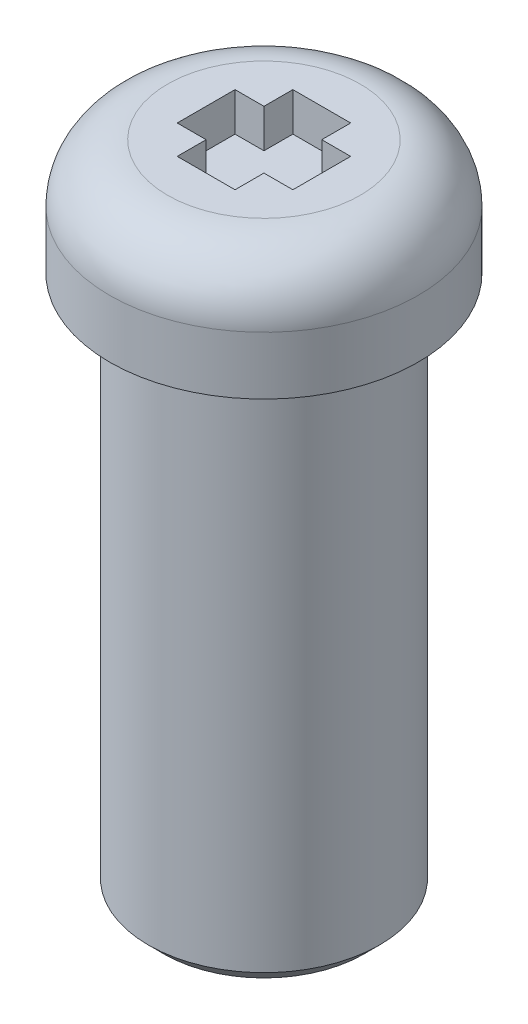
ISO-10303-21;
HEADER;
FILE_DESCRIPTION(('STEP AP214'),'2;1');
FILE_NAME('part.step','',(''),(''),'','','');
FILE_SCHEMA(('AUTOMOTIVE_DESIGN { 1 0 10303 214 1 1 1 1 }'));
ENDSEC;
DATA;
#1=APPLICATION_CONTEXT('core data for automotive mechanical design processes');
#2=APPLICATION_PROTOCOL_DEFINITION('international standard','automotive_design',2000,#1);
#3=PRODUCT_CONTEXT('',#1,'mechanical');
#4=PRODUCT('Part','Part','',(#3));
#5=PRODUCT_RELATED_PRODUCT_CATEGORY('part','',(#4));
#6=PRODUCT_DEFINITION_FORMATION('','',#4);
#7=PRODUCT_DEFINITION_CONTEXT('part definition',#1,'design');
#8=PRODUCT_DEFINITION('design','',#6,#7);
#9=PRODUCT_DEFINITION_SHAPE('','',#8);
#10=(LENGTH_UNIT() NAMED_UNIT(*) SI_UNIT(.MILLI.,.METRE.));
#11=(NAMED_UNIT(*) PLANE_ANGLE_UNIT() SI_UNIT($,.RADIAN.));
#12=(NAMED_UNIT(*) SI_UNIT($,.STERADIAN.) SOLID_ANGLE_UNIT());
#13=UNCERTAINTY_MEASURE_WITH_UNIT(LENGTH_MEASURE(1.E-05),#10,'distance_accuracy_value','');
#14=(GEOMETRIC_REPRESENTATION_CONTEXT(3) GLOBAL_UNCERTAINTY_ASSIGNED_CONTEXT((#13)) GLOBAL_UNIT_ASSIGNED_CONTEXT((#10,
#11,#12)) REPRESENTATION_CONTEXT('',''));
#15=CARTESIAN_POINT('',(0.,0.,0.));
#16=DIRECTION('',(0.,0.,1.));
#17=DIRECTION('',(1.,0.,0.));
#18=AXIS2_PLACEMENT_3D('',#15,#16,#17);
#19=CARTESIAN_POINT('',(4.00000000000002,0.,0.));
#20=DIRECTION('',(0.,1.,0.));
#21=DIRECTION('',(0.,0.,1.));
#22=AXIS2_PLACEMENT_3D('',#19,#20,#21);
#23=PLANE('',#22);
#24=CARTESIAN_POINT('',(0.,0.,0.));
#25=DIRECTION('',(0.,1.,0.));
#26=DIRECTION('',(0.,0.,1.));
#27=AXIS2_PLACEMENT_3D('',#24,#25,#26);
#28=CIRCLE('',#27,3.4572);
#29=CARTESIAN_POINT('',(0.,0.,3.4572));
#30=VERTEX_POINT('',#29);
#31=EDGE_CURVE('E222',#30,#30,#28,.T.);
#32=ORIENTED_EDGE('',*,*,#31,.T.);
#33=EDGE_LOOP('',(#32));
#34=FACE_BOUND('',#33,.T.);
#35=CARTESIAN_POINT('',(0.,0.,0.));
#36=DIRECTION('',(0.,1.,0.));
#37=DIRECTION('',(0.,0.,1.));
#38=AXIS2_PLACEMENT_3D('',#35,#36,#37);
#39=CIRCLE('',#38,4.);
#40=CARTESIAN_POINT('',(0.,0.,4.00000000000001));
#41=VERTEX_POINT('',#40);
#42=EDGE_CURVE('E216',#41,#41,#39,.T.);
#43=ORIENTED_EDGE('',*,*,#42,.F.);
#44=EDGE_LOOP('',(#43));
#45=FACE_BOUND('',#44,.T.);
#46=ADVANCED_FACE('F44',(#34,#45),#23,.F.);
#47=CARTESIAN_POINT('',(0.750000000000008,2.,1.50000000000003));
#48=DIRECTION('',(1.,0.,0.));
#49=DIRECTION('',(0.,0.,-1.));
#50=AXIS2_PLACEMENT_3D('',#47,#48,#49);
#51=PLANE('',#50);
#52=DIRECTION('',(0.,1.,0.));
#53=VECTOR('',#52,1.);
#54=CARTESIAN_POINT('',(0.750000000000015,2.,0.750000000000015));
#55=LINE('',#54,#53);
#56=CARTESIAN_POINT('',(0.750000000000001,2.,0.750000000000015));
#57=VERTEX_POINT('',#56);
#58=CARTESIAN_POINT('',(0.750000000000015,3.,0.750000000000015));
#59=VERTEX_POINT('',#58);
#60=EDGE_CURVE('E166',#57,#59,#55,.T.);
#61=ORIENTED_EDGE('',*,*,#60,.F.);
#62=DIRECTION('',(0.,0.,-1.));
#63=VECTOR('',#62,1.);
#64=CARTESIAN_POINT('',(0.750000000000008,2.,1.50000000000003));
#65=LINE('',#64,#63);
#66=CARTESIAN_POINT('',(0.750000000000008,2.,1.50000000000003));
#67=VERTEX_POINT('',#66);
#68=EDGE_CURVE('E175',#67,#57,#65,.T.);
#69=ORIENTED_EDGE('',*,*,#68,.F.);
#70=DIRECTION('',(0.,1.,0.));
#71=VECTOR('',#70,1.);
#72=CARTESIAN_POINT('',(0.750000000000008,2.,1.50000000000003));
#73=LINE('',#72,#71);
#74=CARTESIAN_POINT('',(0.750000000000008,3.,1.50000000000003));
#75=VERTEX_POINT('',#74);
#76=EDGE_CURVE('E201',#67,#75,#73,.T.);
#77=ORIENTED_EDGE('',*,*,#76,.T.);
#78=DIRECTION('',(0.,0.,-1.));
#79=VECTOR('',#78,1.);
#80=CARTESIAN_POINT('',(0.750000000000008,3.,1.50000000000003));
#81=LINE('',#80,#79);
#82=EDGE_CURVE('E188',#75,#59,#81,.T.);
#83=ORIENTED_EDGE('',*,*,#82,.T.);
#84=EDGE_LOOP('',(#61,#69,#77,#83));
#85=FACE_BOUND('',#84,.T.);
#86=ADVANCED_FACE('F238',(#85),#51,.F.);
#87=CARTESIAN_POINT('',(-0.749999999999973,2.,1.50000000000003));
#88=DIRECTION('',(1.,0.,0.));
#89=DIRECTION('',(0.,0.,-1.));
#90=AXIS2_PLACEMENT_3D('',#87,#88,#89);
#91=PLANE('',#90);
#92=DIRECTION('',(0.,0.,-1.));
#93=VECTOR('',#92,1.);
#94=CARTESIAN_POINT('',(-0.749999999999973,2.,1.50000000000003));
#95=LINE('',#94,#93);
#96=CARTESIAN_POINT('',(-0.749999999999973,2.,1.50000000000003));
#97=VERTEX_POINT('',#96);
#98=CARTESIAN_POINT('',(-0.74999999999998,2.,0.749999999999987));
#99=VERTEX_POINT('',#98);
#100=EDGE_CURVE('E182',#97,#99,#95,.T.);
#101=ORIENTED_EDGE('',*,*,#100,.T.);
#102=DIRECTION('',(0.,1.,0.));
#103=VECTOR('',#102,1.);
#104=CARTESIAN_POINT('',(-0.74999999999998,2.,0.749999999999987));
#105=LINE('',#104,#103);
#106=CARTESIAN_POINT('',(-0.74999999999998,3.,0.749999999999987));
#107=VERTEX_POINT('',#106);
#108=EDGE_CURVE('E163',#99,#107,#105,.T.);
#109=ORIENTED_EDGE('',*,*,#108,.T.);
#110=DIRECTION('',(0.,0.,-1.));
#111=VECTOR('',#110,1.);
#112=CARTESIAN_POINT('',(-0.749999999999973,3.,1.50000000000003));
#113=LINE('',#112,#111);
#114=CARTESIAN_POINT('',(-0.749999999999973,3.,1.50000000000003));
#115=VERTEX_POINT('',#114);
#116=EDGE_CURVE('E195',#115,#107,#113,.T.);
#117=ORIENTED_EDGE('',*,*,#116,.F.);
#118=DIRECTION('',(0.,1.,0.));
#119=VECTOR('',#118,1.);
#120=CARTESIAN_POINT('',(-0.749999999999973,2.,1.50000000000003));
#121=LINE('',#120,#119);
#122=EDGE_CURVE('E204',#97,#115,#121,.T.);
#123=ORIENTED_EDGE('',*,*,#122,.F.);
#124=EDGE_LOOP('',(#101,#109,#117,#123));
#125=FACE_BOUND('',#124,.T.);
#126=ADVANCED_FACE('F244',(#125),#91,.T.);
#127=CARTESIAN_POINT('',(0.,11.5925170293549,0.));
#128=DIRECTION('',(0.,1.,0.));
#129=DIRECTION('',(0.,0.,1.));
#130=AXIS2_PLACEMENT_3D('',#127,#128,#129);
#131=CYLINDRICAL_SURFACE('',#130,4.);
#132=CARTESIAN_POINT('',(0.,1.5,0.));
#133=DIRECTION('',(0.,1.,0.));
#134=DIRECTION('',(0.,0.,1.));
#135=AXIS2_PLACEMENT_3D('',#132,#133,#134);
#136=CIRCLE('',#135,4.);
#137=CARTESIAN_POINT('',(0.,1.5,4.00000000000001));
#138=VERTEX_POINT('',#137);
#139=EDGE_CURVE('E213',#138,#138,#136,.T.);
#140=ORIENTED_EDGE('',*,*,#139,.F.);
#141=EDGE_LOOP('',(#140));
#142=FACE_BOUND('',#141,.T.);
#143=ORIENTED_EDGE('',*,*,#42,.T.);
#144=EDGE_LOOP('',(#143));
#145=FACE_BOUND('',#144,.T.);
#146=ADVANCED_FACE('F250',(#142,#145),#131,.T.);
#147=CARTESIAN_POINT('',(0.,1.5,0.));
#148=DIRECTION('',(0.,1.,0.));
#149=DIRECTION('',(0.,0.,1.));
#150=AXIS2_PLACEMENT_3D('',#147,#148,#149);
#151=TOROIDAL_SURFACE('',#150,2.5,1.5);
#152=CARTESIAN_POINT('',(0.,3.,0.));
#153=DIRECTION('',(0.,1.,0.));
#154=DIRECTION('',(0.,0.,1.));
#155=AXIS2_PLACEMENT_3D('',#152,#153,#154);
#156=CIRCLE('',#155,2.5);
#157=CARTESIAN_POINT('',(0.,3.,2.5));
#158=VERTEX_POINT('',#157);
#159=EDGE_CURVE('E203',#158,#158,#156,.T.);
#160=ORIENTED_EDGE('',*,*,#159,.F.);
#161=EDGE_LOOP('',(#160));
#162=FACE_BOUND('',#161,.T.);
#163=ORIENTED_EDGE('',*,*,#139,.T.);
#164=EDGE_LOOP('',(#163));
#165=FACE_BOUND('',#164,.T.);
#166=ADVANCED_FACE('F253',(#162,#165),#151,.T.);
#167=CARTESIAN_POINT('',(0.,3.,0.));
#168=DIRECTION('',(0.,-1.,0.));
#169=DIRECTION('',(0.,0.,-1.));
#170=AXIS2_PLACEMENT_3D('',#167,#168,#169);
#171=PLANE('',#170);
#172=CARTESIAN_POINT('',(0.750000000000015,3.,-0.750000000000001));
#173=VERTEX_POINT('',#172);
#174=CARTESIAN_POINT('',(0.750000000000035,3.,-1.5));
#175=VERTEX_POINT('',#174);
#176=EDGE_CURVE('E174',#173,#175,#81,.T.);
#177=ORIENTED_EDGE('',*,*,#176,.F.);
#178=DIRECTION('',(-1.,0.,0.));
#179=VECTOR('',#178,1.);
#180=CARTESIAN_POINT('',(1.50000000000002,3.,-0.750000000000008));
#181=LINE('',#180,#179);
#182=CARTESIAN_POINT('',(1.50000000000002,3.,-0.750000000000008));
#183=VERTEX_POINT('',#182);
#184=EDGE_CURVE('E410',#183,#173,#181,.T.);
#185=ORIENTED_EDGE('',*,*,#184,.F.);
#186=DIRECTION('',(0.,0.,1.));
#187=VECTOR('',#186,1.);
#188=CARTESIAN_POINT('',(1.50000000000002,3.,-0.750000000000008));
#189=LINE('',#188,#187);
#190=CARTESIAN_POINT('',(1.50000000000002,3.,0.750000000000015));
#191=VERTEX_POINT('',#190);
#192=EDGE_CURVE('E141',#183,#191,#189,.T.);
#193=ORIENTED_EDGE('',*,*,#192,.T.);
#194=DIRECTION('',(-1.,0.,0.));
#195=VECTOR('',#194,1.);
#196=CARTESIAN_POINT('',(1.50000000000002,3.,0.750000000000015));
#197=LINE('',#196,#195);
#198=EDGE_CURVE('E395',#191,#59,#197,.T.);
#199=ORIENTED_EDGE('',*,*,#198,.T.);
#200=ORIENTED_EDGE('',*,*,#82,.F.);
#201=DIRECTION('',(-1.,0.,0.));
#202=VECTOR('',#201,1.);
#203=CARTESIAN_POINT('',(0.750000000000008,3.,1.50000000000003));
#204=LINE('',#203,#202);
#205=EDGE_CURVE('E198',#75,#115,#204,.T.);
#206=ORIENTED_EDGE('',*,*,#205,.T.);
#207=ORIENTED_EDGE('',*,*,#116,.T.);
#208=CARTESIAN_POINT('',(-1.49999999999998,3.,0.750000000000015));
#209=VERTEX_POINT('',#208);
#210=EDGE_CURVE('E401',#107,#209,#197,.T.);
#211=ORIENTED_EDGE('',*,*,#210,.T.);
#212=DIRECTION('',(0.,0.,-1.));
#213=VECTOR('',#212,1.);
#214=CARTESIAN_POINT('',(-1.49999999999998,3.,0.750000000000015));
#215=LINE('',#214,#213);
#216=CARTESIAN_POINT('',(-1.49999999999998,3.,-0.750000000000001));
#217=VERTEX_POINT('',#216);
#218=EDGE_CURVE('E405',#209,#217,#215,.T.);
#219=ORIENTED_EDGE('',*,*,#218,.T.);
#220=CARTESIAN_POINT('',(-0.749999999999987,3.,-0.750000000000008));
#221=VERTEX_POINT('',#220);
#222=EDGE_CURVE('E154',#221,#217,#181,.T.);
#223=ORIENTED_EDGE('',*,*,#222,.F.);
#224=CARTESIAN_POINT('',(-0.749999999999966,3.,-1.5));
#225=VERTEX_POINT('',#224);
#226=EDGE_CURVE('E194',#221,#225,#113,.T.);
#227=ORIENTED_EDGE('',*,*,#226,.T.);
#228=DIRECTION('',(1.,0.,0.));
#229=VECTOR('',#228,1.);
#230=CARTESIAN_POINT('',(-0.749999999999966,3.,-1.5));
#231=LINE('',#230,#229);
#232=EDGE_CURVE('E191',#225,#175,#231,.T.);
#233=ORIENTED_EDGE('',*,*,#232,.T.);
#234=EDGE_LOOP('',(#177,#185,#193,#199,#200,#206,#207,#211,#219,#223,#227,#233));
#235=FACE_BOUND('',#234,.T.);
#236=ORIENTED_EDGE('',*,*,#159,.T.);
#237=EDGE_LOOP('',(#236));
#238=FACE_BOUND('',#237,.T.);
#239=ADVANCED_FACE('F257',(#235,#238),#171,.F.);
#240=CARTESIAN_POINT('',(0.750000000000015,2.,-0.750000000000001));
#241=VERTEX_POINT('',#240);
#242=CARTESIAN_POINT('',(0.750000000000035,2.,-1.5));
#243=VERTEX_POINT('',#242);
#244=EDGE_CURVE('E179',#241,#243,#65,.T.);
#245=ORIENTED_EDGE('',*,*,#244,.F.);
#246=DIRECTION('',(0.,1.,0.));
#247=VECTOR('',#246,1.);
#248=CARTESIAN_POINT('',(0.750000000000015,2.,-0.750000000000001));
#249=LINE('',#248,#247);
#250=EDGE_CURVE('E171',#241,#173,#249,.T.);
#251=ORIENTED_EDGE('',*,*,#250,.T.);
#252=ORIENTED_EDGE('',*,*,#176,.T.);
#253=DIRECTION('',(0.,1.,0.));
#254=VECTOR('',#253,1.);
#255=CARTESIAN_POINT('',(0.750000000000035,2.,-1.5));
#256=LINE('',#255,#254);
#257=EDGE_CURVE('E187',#243,#175,#256,.T.);
#258=ORIENTED_EDGE('',*,*,#257,.F.);
#259=EDGE_LOOP('',(#245,#251,#252,#258));
#260=FACE_BOUND('',#259,.T.);
#261=ADVANCED_FACE('F247',(#260),#51,.F.);
#262=CARTESIAN_POINT('',(0.750000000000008,2.,1.50000000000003));
#263=DIRECTION('',(0.,0.,-1.));
#264=DIRECTION('',(-1.,0.,0.));
#265=AXIS2_PLACEMENT_3D('',#262,#263,#264);
#266=PLANE('',#265);
#267=ORIENTED_EDGE('',*,*,#205,.F.);
#268=ORIENTED_EDGE('',*,*,#76,.F.);
#269=DIRECTION('',(-1.,0.,0.));
#270=VECTOR('',#269,1.);
#271=CARTESIAN_POINT('',(0.750000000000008,2.,1.50000000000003));
#272=LINE('',#271,#270);
#273=EDGE_CURVE('E185',#67,#97,#272,.T.);
#274=ORIENTED_EDGE('',*,*,#273,.T.);
#275=ORIENTED_EDGE('',*,*,#122,.T.);
#276=EDGE_LOOP('',(#267,#268,#274,#275));
#277=FACE_BOUND('',#276,.T.);
#278=ADVANCED_FACE('F263',(#277),#266,.T.);
#279=DIRECTION('',(0.,1.,0.));
#280=VECTOR('',#279,1.);
#281=CARTESIAN_POINT('',(-0.749999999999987,2.,-0.750000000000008));
#282=LINE('',#281,#280);
#283=CARTESIAN_POINT('',(-0.749999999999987,2.,-0.750000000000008));
#284=VERTEX_POINT('',#283);
#285=EDGE_CURVE('E169',#284,#221,#282,.T.);
#286=ORIENTED_EDGE('',*,*,#285,.F.);
#287=CARTESIAN_POINT('',(-0.749999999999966,2.,-1.5));
#288=VERTEX_POINT('',#287);
#289=EDGE_CURVE('E137',#284,#288,#95,.T.);
#290=ORIENTED_EDGE('',*,*,#289,.T.);
#291=DIRECTION('',(0.,1.,0.));
#292=VECTOR('',#291,1.);
#293=CARTESIAN_POINT('',(-0.749999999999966,2.,-1.5));
#294=LINE('',#293,#292);
#295=EDGE_CURVE('E206',#288,#225,#294,.T.);
#296=ORIENTED_EDGE('',*,*,#295,.T.);
#297=ORIENTED_EDGE('',*,*,#226,.F.);
#298=EDGE_LOOP('',(#286,#290,#296,#297));
#299=FACE_BOUND('',#298,.T.);
#300=ADVANCED_FACE('F268',(#299),#91,.T.);
#301=CARTESIAN_POINT('',(-0.749999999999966,2.,-1.5));
#302=DIRECTION('',(0.,0.,1.));
#303=DIRECTION('',(1.,0.,0.));
#304=AXIS2_PLACEMENT_3D('',#301,#302,#303);
#305=PLANE('',#304);
#306=ORIENTED_EDGE('',*,*,#232,.F.);
#307=ORIENTED_EDGE('',*,*,#295,.F.);
#308=DIRECTION('',(1.,0.,0.));
#309=VECTOR('',#308,1.);
#310=CARTESIAN_POINT('',(-0.749999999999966,2.,-1.5));
#311=LINE('',#310,#309);
#312=EDGE_CURVE('E178',#288,#243,#311,.T.);
#313=ORIENTED_EDGE('',*,*,#312,.T.);
#314=ORIENTED_EDGE('',*,*,#257,.T.);
#315=EDGE_LOOP('',(#306,#307,#313,#314));
#316=FACE_BOUND('',#315,.T.);
#317=ADVANCED_FACE('F265',(#316),#305,.T.);
#318=CARTESIAN_POINT('',(0.750000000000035,2.,-1.5));
#319=DIRECTION('',(0.,-1.,0.));
#320=DIRECTION('',(0.,0.,-1.));
#321=AXIS2_PLACEMENT_3D('',#318,#319,#320);
#322=PLANE('',#321);
#323=ORIENTED_EDGE('',*,*,#289,.F.);
#324=DIRECTION('',(-1.,0.,0.));
#325=VECTOR('',#324,1.);
#326=CARTESIAN_POINT('',(1.50000000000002,2.,-0.750000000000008));
#327=LINE('',#326,#325);
#328=CARTESIAN_POINT('',(-1.49999999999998,2.,-0.750000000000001));
#329=VERTEX_POINT('',#328);
#330=EDGE_CURVE('E132',#284,#329,#327,.T.);
#331=ORIENTED_EDGE('',*,*,#330,.T.);
#332=DIRECTION('',(0.,0.,-1.));
#333=VECTOR('',#332,1.);
#334=CARTESIAN_POINT('',(-1.49999999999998,2.,0.750000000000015));
#335=LINE('',#334,#333);
#336=CARTESIAN_POINT('',(-1.49999999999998,2.,0.750000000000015));
#337=VERTEX_POINT('',#336);
#338=EDGE_CURVE('E135',#337,#329,#335,.T.);
#339=ORIENTED_EDGE('',*,*,#338,.F.);
#340=DIRECTION('',(-1.,0.,0.));
#341=VECTOR('',#340,1.);
#342=CARTESIAN_POINT('',(1.50000000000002,2.,0.750000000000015));
#343=LINE('',#342,#341);
#344=EDGE_CURVE('E59',#99,#337,#343,.T.);
#345=ORIENTED_EDGE('',*,*,#344,.F.);
#346=ORIENTED_EDGE('',*,*,#100,.F.);
#347=ORIENTED_EDGE('',*,*,#273,.F.);
#348=ORIENTED_EDGE('',*,*,#68,.T.);
#349=CARTESIAN_POINT('',(1.50000000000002,2.,0.750000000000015));
#350=VERTEX_POINT('',#349);
#351=EDGE_CURVE('E159',#350,#57,#343,.T.);
#352=ORIENTED_EDGE('',*,*,#351,.F.);
#353=DIRECTION('',(0.,0.,1.));
#354=VECTOR('',#353,1.);
#355=CARTESIAN_POINT('',(1.50000000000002,2.,-0.750000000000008));
#356=LINE('',#355,#354);
#357=CARTESIAN_POINT('',(1.50000000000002,2.,-0.750000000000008));
#358=VERTEX_POINT('',#357);
#359=EDGE_CURVE('E155',#358,#350,#356,.T.);
#360=ORIENTED_EDGE('',*,*,#359,.F.);
#361=EDGE_CURVE('E66',#358,#241,#327,.T.);
#362=ORIENTED_EDGE('',*,*,#361,.T.);
#363=ORIENTED_EDGE('',*,*,#244,.T.);
#364=ORIENTED_EDGE('',*,*,#312,.F.);
#365=EDGE_LOOP('',(#323,#331,#339,#345,#346,#347,#348,#352,#360,#362,#363,#364));
#366=FACE_BOUND('',#365,.T.);
#367=ADVANCED_FACE('F134',(#366),#322,.F.);
#368=CARTESIAN_POINT('',(1.50000000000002,2.,0.750000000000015));
#369=DIRECTION('',(0.,0.,-1.));
#370=DIRECTION('',(-1.,0.,0.));
#371=AXIS2_PLACEMENT_3D('',#368,#369,#370);
#372=PLANE('',#371);
#373=ORIENTED_EDGE('',*,*,#344,.T.);
#374=DIRECTION('',(0.,1.,0.));
#375=VECTOR('',#374,1.);
#376=CARTESIAN_POINT('',(-1.49999999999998,2.,0.750000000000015));
#377=LINE('',#376,#375);
#378=EDGE_CURVE('E150',#337,#209,#377,.T.);
#379=ORIENTED_EDGE('',*,*,#378,.T.);
#380=ORIENTED_EDGE('',*,*,#210,.F.);
#381=ORIENTED_EDGE('',*,*,#108,.F.);
#382=EDGE_LOOP('',(#373,#379,#380,#381));
#383=FACE_BOUND('',#382,.T.);
#384=ADVANCED_FACE('F278',(#383),#372,.T.);
#385=CARTESIAN_POINT('',(1.50000000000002,2.,-0.750000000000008));
#386=DIRECTION('',(0.,0.,-1.));
#387=DIRECTION('',(-1.,0.,0.));
#388=AXIS2_PLACEMENT_3D('',#385,#386,#387);
#389=PLANE('',#388);
#390=ORIENTED_EDGE('',*,*,#285,.T.);
#391=ORIENTED_EDGE('',*,*,#222,.T.);
#392=DIRECTION('',(0.,1.,0.));
#393=VECTOR('',#392,1.);
#394=CARTESIAN_POINT('',(-1.49999999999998,2.,-0.750000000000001));
#395=LINE('',#394,#393);
#396=EDGE_CURVE('E148',#329,#217,#395,.T.);
#397=ORIENTED_EDGE('',*,*,#396,.F.);
#398=ORIENTED_EDGE('',*,*,#330,.F.);
#399=EDGE_LOOP('',(#390,#391,#397,#398));
#400=FACE_BOUND('',#399,.T.);
#401=ADVANCED_FACE('F152',(#400),#389,.F.);
#402=CARTESIAN_POINT('',(-1.49999999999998,2.,0.750000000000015));
#403=DIRECTION('',(1.,0.,0.));
#404=DIRECTION('',(0.,0.,-1.));
#405=AXIS2_PLACEMENT_3D('',#402,#403,#404);
#406=PLANE('',#405);
#407=ORIENTED_EDGE('',*,*,#218,.F.);
#408=ORIENTED_EDGE('',*,*,#378,.F.);
#409=ORIENTED_EDGE('',*,*,#338,.T.);
#410=ORIENTED_EDGE('',*,*,#396,.T.);
#411=EDGE_LOOP('',(#407,#408,#409,#410));
#412=FACE_BOUND('',#411,.T.);
#413=ADVANCED_FACE('F147',(#412),#406,.T.);
#414=ORIENTED_EDGE('',*,*,#361,.F.);
#415=DIRECTION('',(0.,1.,0.));
#416=VECTOR('',#415,1.);
#417=CARTESIAN_POINT('',(1.50000000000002,2.,-0.750000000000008));
#418=LINE('',#417,#416);
#419=EDGE_CURVE('E167',#358,#183,#418,.T.);
#420=ORIENTED_EDGE('',*,*,#419,.T.);
#421=ORIENTED_EDGE('',*,*,#184,.T.);
#422=ORIENTED_EDGE('',*,*,#250,.F.);
#423=EDGE_LOOP('',(#414,#420,#421,#422));
#424=FACE_BOUND('',#423,.T.);
#425=ADVANCED_FACE('F281',(#424),#389,.F.);
#426=ORIENTED_EDGE('',*,*,#60,.T.);
#427=ORIENTED_EDGE('',*,*,#198,.F.);
#428=DIRECTION('',(0.,1.,0.));
#429=VECTOR('',#428,1.);
#430=CARTESIAN_POINT('',(1.50000000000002,2.,0.750000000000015));
#431=LINE('',#430,#429);
#432=EDGE_CURVE('E157',#350,#191,#431,.T.);
#433=ORIENTED_EDGE('',*,*,#432,.F.);
#434=ORIENTED_EDGE('',*,*,#351,.T.);
#435=EDGE_LOOP('',(#426,#427,#433,#434));
#436=FACE_BOUND('',#435,.T.);
#437=ADVANCED_FACE('F287',(#436),#372,.T.);
#438=CARTESIAN_POINT('',(1.50000000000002,2.,-0.750000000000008));
#439=DIRECTION('',(-1.,0.,0.));
#440=DIRECTION('',(0.,0.,1.));
#441=AXIS2_PLACEMENT_3D('',#438,#439,#440);
#442=PLANE('',#441);
#443=ORIENTED_EDGE('',*,*,#192,.F.);
#444=ORIENTED_EDGE('',*,*,#419,.F.);
#445=ORIENTED_EDGE('',*,*,#359,.T.);
#446=ORIENTED_EDGE('',*,*,#432,.T.);
#447=EDGE_LOOP('',(#443,#444,#445,#446));
#448=FACE_BOUND('',#447,.T.);
#449=ADVANCED_FACE('F288',(#448),#442,.T.);
#450=CARTESIAN_POINT('',(0.,-14.,0.));
#451=DIRECTION('',(0.,1.,0.));
#452=DIRECTION('',(0.,0.,1.));
#453=AXIS2_PLACEMENT_3D('',#450,#451,#452);
#454=CYLINDRICAL_SURFACE('',#453,3.);
#455=CARTESIAN_POINT('',(0.,-13.5936,0.));
#456=DIRECTION('',(0.,-1.,0.));
#457=DIRECTION('',(0.,0.,-1.));
#458=AXIS2_PLACEMENT_3D('',#455,#456,#457);
#459=CIRCLE('',#458,3.);
#460=CARTESIAN_POINT('',(0.,-13.5936,-3.));
#461=VERTEX_POINT('',#460);
#462=EDGE_CURVE('E13',#461,#461,#459,.F.);
#463=ORIENTED_EDGE('',*,*,#462,.T.);
#464=EDGE_LOOP('',(#463));
#465=FACE_BOUND('',#464,.T.);
#466=CARTESIAN_POINT('',(0.,-0.457199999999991,0.));
#467=DIRECTION('',(0.,1.,0.));
#468=DIRECTION('',(0.,0.,1.));
#469=AXIS2_PLACEMENT_3D('',#466,#467,#468);
#470=CIRCLE('',#469,3.);
#471=CARTESIAN_POINT('',(0.,-0.457199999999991,3.));
#472=VERTEX_POINT('',#471);
#473=EDGE_CURVE('E219',#472,#472,#470,.F.);
#474=ORIENTED_EDGE('',*,*,#473,.T.);
#475=EDGE_LOOP('',(#474));
#476=FACE_BOUND('',#475,.T.);
#477=ADVANCED_FACE('F291',(#465,#476),#454,.T.);
#478=CARTESIAN_POINT('',(0.,-14.,0.));
#479=DIRECTION('',(0.,-1.,0.));
#480=DIRECTION('',(0.,0.,-1.));
#481=AXIS2_PLACEMENT_3D('',#478,#479,#480);
#482=PLANE('',#481);
#483=CARTESIAN_POINT('',(0.,-14.,0.));
#484=DIRECTION('',(0.,-1.,0.));
#485=DIRECTION('',(0.,0.,-1.));
#486=AXIS2_PLACEMENT_3D('',#483,#484,#485);
#487=CIRCLE('',#486,2.5936);
#488=CARTESIAN_POINT('',(0.,-14.,-2.5936));
#489=VERTEX_POINT('',#488);
#490=EDGE_CURVE('E52',#489,#489,#487,.T.);
#491=ORIENTED_EDGE('',*,*,#490,.T.);
#492=EDGE_LOOP('',(#491));
#493=FACE_BOUND('',#492,.T.);
#494=ADVANCED_FACE('F227',(#493),#482,.T.);
#495=CARTESIAN_POINT('',(0.,-0.457199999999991,0.));
#496=DIRECTION('',(0.,1.,0.));
#497=DIRECTION('',(0.,0.,1.));
#498=AXIS2_PLACEMENT_3D('',#495,#496,#497);
#499=TOROIDAL_SURFACE('',#498,3.4572,0.4572);
#500=ORIENTED_EDGE('',*,*,#31,.F.);
#501=EDGE_LOOP('',(#500));
#502=FACE_BOUND('',#501,.T.);
#503=ORIENTED_EDGE('',*,*,#473,.F.);
#504=EDGE_LOOP('',(#503));
#505=FACE_BOUND('',#504,.T.);
#506=ADVANCED_FACE('F230',(#502,#505),#499,.F.);
#507=CARTESIAN_POINT('',(0.,-14.,0.));
#508=DIRECTION('',(0.,1.,0.));
#509=DIRECTION('',(0.,0.,1.));
#510=AXIS2_PLACEMENT_3D('',#507,#508,#509);
#511=CONICAL_SURFACE('',#510,2.5936,0.785398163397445);
#512=ORIENTED_EDGE('',*,*,#462,.F.);
#513=EDGE_LOOP('',(#512));
#514=FACE_BOUND('',#513,.T.);
#515=ORIENTED_EDGE('',*,*,#490,.F.);
#516=EDGE_LOOP('',(#515));
#517=FACE_BOUND('',#516,.T.);
#518=ADVANCED_FACE('F46',(#514,#517),#511,.T.);
#519=CLOSED_SHELL('',(#46,#86,#126,#146,#166,#239,#261,#278,#300,#317,#367,#384,#401,#413,#425,
#437,#449,#477,#494,#506,#518));
#520=MANIFOLD_SOLID_BREP('B2',#519);
#521=ADVANCED_BREP_SHAPE_REPRESENTATION('',(#18,#520),#14);
#522=SHAPE_DEFINITION_REPRESENTATION(#9,#521);
ENDSEC;
END-ISO-10303-21;
